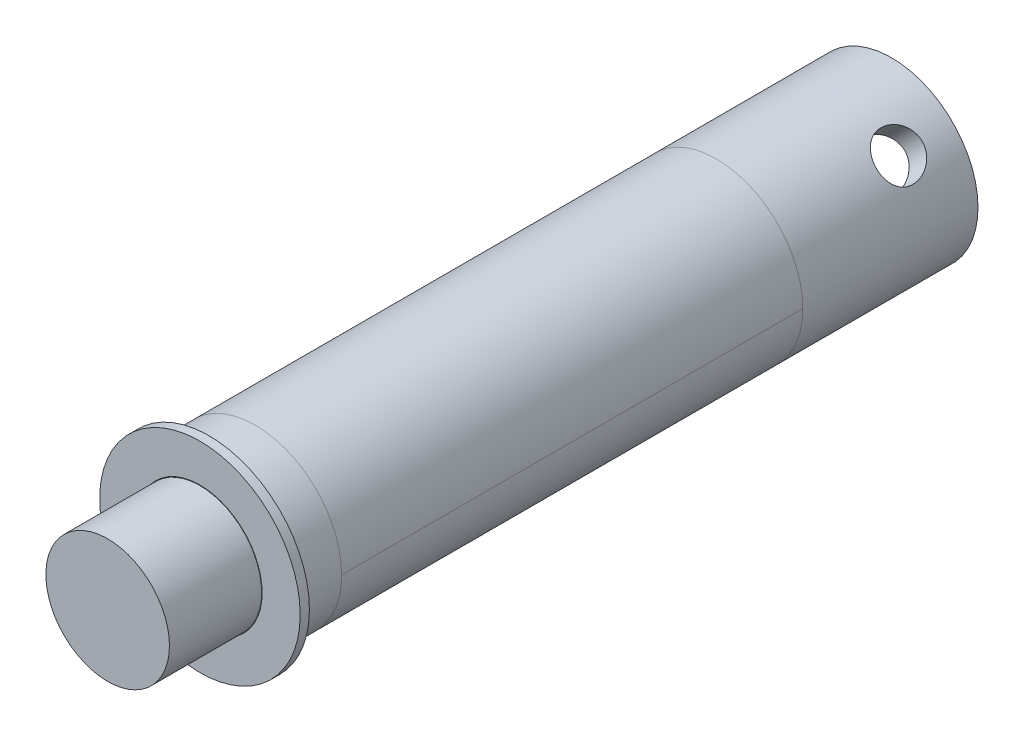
ISO-10303-21;
HEADER;
FILE_DESCRIPTION(('STEP AP214'),'2;1');
FILE_NAME('part.step','',(''),(''),'','','');
FILE_SCHEMA(('AUTOMOTIVE_DESIGN { 1 0 10303 214 1 1 1 1 }'));
ENDSEC;
DATA;
#1=APPLICATION_CONTEXT('core data for automotive mechanical design processes');
#2=APPLICATION_PROTOCOL_DEFINITION('international standard','automotive_design',2000,#1);
#3=PRODUCT_CONTEXT('',#1,'mechanical');
#4=PRODUCT('Part','Part','',(#3));
#5=PRODUCT_RELATED_PRODUCT_CATEGORY('part','',(#4));
#6=PRODUCT_DEFINITION_FORMATION('','',#4);
#7=PRODUCT_DEFINITION_CONTEXT('part definition',#1,'design');
#8=PRODUCT_DEFINITION('design','',#6,#7);
#9=PRODUCT_DEFINITION_SHAPE('','',#8);
#10=(LENGTH_UNIT() NAMED_UNIT(*) SI_UNIT(.MILLI.,.METRE.));
#11=(NAMED_UNIT(*) PLANE_ANGLE_UNIT() SI_UNIT($,.RADIAN.));
#12=(NAMED_UNIT(*) SI_UNIT($,.STERADIAN.) SOLID_ANGLE_UNIT());
#13=UNCERTAINTY_MEASURE_WITH_UNIT(LENGTH_MEASURE(1.E-05),#10,'distance_accuracy_value','');
#14=(GEOMETRIC_REPRESENTATION_CONTEXT(3) GLOBAL_UNCERTAINTY_ASSIGNED_CONTEXT((#13)) GLOBAL_UNIT_ASSIGNED_CONTEXT((#10,
#11,#12)) REPRESENTATION_CONTEXT('',''));
#15=CARTESIAN_POINT('',(0.,0.,0.));
#16=DIRECTION('',(0.,0.,1.));
#17=DIRECTION('',(1.,0.,0.));
#18=AXIS2_PLACEMENT_3D('',#15,#16,#17);
#19=CARTESIAN_POINT('',(0.,0.,215.9));
#20=DIRECTION('',(0.,0.,-1.));
#21=DIRECTION('',(-1.,0.,0.));
#22=AXIS2_PLACEMENT_3D('',#19,#20,#21);
#23=CYLINDRICAL_SURFACE('',#22,17.018);
#24=CARTESIAN_POINT('',(0.,0.,215.9));
#25=DIRECTION('',(0.,0.,1.));
#26=DIRECTION('',(1.,0.,0.));
#27=AXIS2_PLACEMENT_3D('',#24,#25,#26);
#28=CIRCLE('',#27,17.018);
#29=CARTESIAN_POINT('',(17.018,0.,215.9));
#30=VERTEX_POINT('',#29);
#31=EDGE_CURVE('E11',#30,#30,#28,.T.);
#32=ORIENTED_EDGE('',*,*,#31,.F.);
#33=EDGE_LOOP('',(#32));
#34=FACE_BOUND('',#33,.T.);
#35=CARTESIAN_POINT('',(0.,0.,190.5));
#36=DIRECTION('',(0.,0.,1.));
#37=DIRECTION('',(1.,0.,0.));
#38=AXIS2_PLACEMENT_3D('',#35,#36,#37);
#39=CIRCLE('',#38,17.018);
#40=CARTESIAN_POINT('',(17.018,0.,190.5));
#41=VERTEX_POINT('',#40);
#42=EDGE_CURVE('E51',#41,#41,#39,.T.);
#43=ORIENTED_EDGE('',*,*,#42,.T.);
#44=EDGE_LOOP('',(#43));
#45=FACE_BOUND('',#44,.T.);
#46=ADVANCED_FACE('F48',(#34,#45),#23,.T.);
#47=CARTESIAN_POINT('',(0.,0.,215.9));
#48=DIRECTION('',(0.,0.,1.));
#49=DIRECTION('',(1.,0.,0.));
#50=AXIS2_PLACEMENT_3D('',#47,#48,#49);
#51=PLANE('',#50);
#52=ORIENTED_EDGE('',*,*,#31,.T.);
#53=EDGE_LOOP('',(#52));
#54=FACE_BOUND('',#53,.T.);
#55=ADVANCED_FACE('F63',(#54),#51,.T.);
#56=CARTESIAN_POINT('',(0.,0.,190.5));
#57=DIRECTION('',(0.,0.,1.));
#58=DIRECTION('',(1.,0.,0.));
#59=AXIS2_PLACEMENT_3D('',#56,#57,#58);
#60=PLANE('',#59);
#61=ORIENTED_EDGE('',*,*,#42,.F.);
#62=EDGE_LOOP('',(#61));
#63=FACE_BOUND('',#62,.T.);
#64=ADVANCED_FACE('F61',(#63),#60,.F.);
#65=CLOSED_SHELL('',(#46,#55,#64));
#66=MANIFOLD_SOLID_BREP('B2',#65);
#67=CARTESIAN_POINT('',(0.,0.,190.5));
#68=DIRECTION('',(0.,0.,-1.));
#69=DIRECTION('',(-1.,0.,0.));
#70=AXIS2_PLACEMENT_3D('',#67,#68,#69);
#71=CYLINDRICAL_SURFACE('',#70,23.8125);
#72=DIRECTION('',(0.,0.,-1.));
#73=VECTOR('',#72,1.);
#74=CARTESIAN_POINT('',(23.8125,0.,190.5));
#75=LINE('',#74,#73);
#76=CARTESIAN_POINT('',(23.8125,0.,175.26));
#77=VERTEX_POINT('',#76);
#78=CARTESIAN_POINT('',(23.8125,0.,48.26));
#79=VERTEX_POINT('',#78);
#80=EDGE_CURVE('E46',#77,#79,#75,.T.);
#81=ORIENTED_EDGE('',*,*,#80,.F.);
#82=CARTESIAN_POINT('',(0.,0.,175.26));
#83=DIRECTION('',(0.,0.,-1.));
#84=DIRECTION('',(-1.,0.,0.));
#85=AXIS2_PLACEMENT_3D('',#82,#83,#84);
#86=CIRCLE('',#85,23.8125);
#87=CARTESIAN_POINT('',(-23.8125,0.,175.26));
#88=VERTEX_POINT('',#87);
#89=EDGE_CURVE('E196',#77,#88,#86,.T.);
#90=ORIENTED_EDGE('',*,*,#89,.T.);
#91=DIRECTION('',(0.,0.,-1.));
#92=VECTOR('',#91,1.);
#93=CARTESIAN_POINT('',(-23.8125,0.,190.5));
#94=LINE('',#93,#92);
#95=CARTESIAN_POINT('',(-23.8125,0.,48.26));
#96=VERTEX_POINT('',#95);
#97=EDGE_CURVE('E98',#96,#88,#94,.F.);
#98=ORIENTED_EDGE('',*,*,#97,.F.);
#99=CARTESIAN_POINT('',(0.,0.,48.26));
#100=DIRECTION('',(0.,0.,1.));
#101=DIRECTION('',(1.,0.,0.));
#102=AXIS2_PLACEMENT_3D('',#99,#100,#101);
#103=CIRCLE('',#102,23.8125);
#104=EDGE_CURVE('E119',#96,#79,#103,.T.);
#105=ORIENTED_EDGE('',*,*,#104,.T.);
#106=EDGE_LOOP('',(#81,#90,#98,#105));
#107=FACE_BOUND('',#106,.T.);
#108=ADVANCED_FACE('F88',(#107),#71,.T.);
#109=CARTESIAN_POINT('',(-20.8590593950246,-11.4862873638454,14.9217756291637));
#110=CARTESIAN_POINT('',(-20.8590605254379,-11.4862799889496,15.0967353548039));
#111=CARTESIAN_POINT('',(-20.8554421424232,-11.4928622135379,15.271632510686));
#112=CARTESIAN_POINT('',(-20.8409713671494,-11.5190852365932,15.6201923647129));
#113=CARTESIAN_POINT('',(-20.8301182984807,-11.5387272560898,15.7938549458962));
#114=CARTESIAN_POINT('',(-20.8011745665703,-11.5908226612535,16.1386700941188));
#115=CARTESIAN_POINT('',(-20.7830820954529,-11.6232792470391,16.309822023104));
#116=CARTESIAN_POINT('',(-20.7396548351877,-11.7005914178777,16.648432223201));
#117=CARTESIAN_POINT('',(-20.7143173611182,-11.7454515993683,16.8158891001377));
#118=CARTESIAN_POINT('',(-20.6564589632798,-11.8469092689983,17.1455899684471));
#119=CARTESIAN_POINT('',(-20.6239510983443,-11.9034854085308,17.3078428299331));
#120=CARTESIAN_POINT('',(-20.5517177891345,-12.0277685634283,17.6264372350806));
#121=CARTESIAN_POINT('',(-20.5119896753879,-12.0954796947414,17.7827765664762));
#122=CARTESIAN_POINT('',(-20.4253470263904,-12.2412228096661,18.0884284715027));
#123=CARTESIAN_POINT('',(-20.3784348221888,-12.3192514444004,18.2377433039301));
#124=CARTESIAN_POINT('',(-20.2774127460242,-12.4848345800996,18.5285231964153));
#125=CARTESIAN_POINT('',(-20.2233001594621,-12.5723926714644,18.6699852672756));
#126=CARTESIAN_POINT('',(-20.1066369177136,-12.7581581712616,18.9471813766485));
#127=CARTESIAN_POINT('',(-20.0439253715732,-12.8565591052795,19.0827180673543));
#128=CARTESIAN_POINT('',(-19.9110588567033,-13.0613856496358,19.3437964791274));
#129=CARTESIAN_POINT('',(-19.840901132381,-13.1678142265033,19.4693344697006));
#130=CARTESIAN_POINT('',(-19.6932729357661,-13.3875939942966,19.7095134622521));
#131=CARTESIAN_POINT('',(-19.615804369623,-13.5009433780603,19.8241572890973));
#132=CARTESIAN_POINT('',(-19.4536524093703,-13.7335599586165,20.0418577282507));
#133=CARTESIAN_POINT('',(-19.3689663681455,-13.852829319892,20.1449100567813));
#134=CARTESIAN_POINT('',(-19.1912091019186,-14.0980829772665,20.3402010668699));
#135=CARTESIAN_POINT('',(-19.0980260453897,-14.2241438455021,20.4322419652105));
#136=CARTESIAN_POINT('',(-18.9047560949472,-14.4800226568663,20.6028777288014));
#137=CARTESIAN_POINT('',(-18.804669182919,-14.6098406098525,20.6814725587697));
#138=CARTESIAN_POINT('',(-18.5980097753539,-14.8720221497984,20.8245797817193));
#139=CARTESIAN_POINT('',(-18.4914381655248,-15.0043853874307,20.8890940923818));
#140=CARTESIAN_POINT('',(-18.2723136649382,-15.2704750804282,21.0035117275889));
#141=CARTESIAN_POINT('',(-18.1597607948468,-15.4042015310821,21.0534151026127));
#142=CARTESIAN_POINT('',(-17.9319552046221,-15.6687558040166,21.1372003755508));
#143=CARTESIAN_POINT('',(-17.8168234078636,-15.7995798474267,21.1714231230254));
#144=CARTESIAN_POINT('',(-17.582169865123,-16.0602993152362,21.2252024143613));
#145=CARTESIAN_POINT('',(-17.4626482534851,-16.1901947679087,21.2447594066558));
#146=CARTESIAN_POINT('',(-17.2200424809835,-16.4479974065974,21.2690321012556));
#147=CARTESIAN_POINT('',(-17.0969588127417,-16.5759048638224,21.2737498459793));
#148=CARTESIAN_POINT('',(-16.8481202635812,-16.8287689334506,21.2683072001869));
#149=CARTESIAN_POINT('',(-16.7223654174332,-16.9537255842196,21.2581470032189));
#150=CARTESIAN_POINT('',(-16.4723913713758,-17.1966589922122,21.2234873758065));
#151=CARTESIAN_POINT('',(-16.3482144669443,-17.3147324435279,21.1993592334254));
#152=CARTESIAN_POINT('',(-16.0991826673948,-17.5465217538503,21.1372548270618));
#153=CARTESIAN_POINT('',(-15.9743275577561,-17.6602361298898,21.0992738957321));
#154=CARTESIAN_POINT('',(-15.7250133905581,-17.8825888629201,21.0097820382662));
#155=CARTESIAN_POINT('',(-15.6005542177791,-17.9912288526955,20.9582755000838));
#156=CARTESIAN_POINT('',(-15.3530030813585,-18.2029407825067,20.8421428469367));
#157=CARTESIAN_POINT('',(-15.229911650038,-18.306010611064,20.777511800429));
#158=CARTESIAN_POINT('',(-14.8619123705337,-18.6080537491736,20.5632453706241));
#159=CARTESIAN_POINT('',(-14.6205273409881,-18.7978702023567,20.3940431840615));
#160=CARTESIAN_POINT('',(-14.1560495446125,-19.1501106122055,20.0088417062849));
#161=CARTESIAN_POINT('',(-13.9329603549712,-19.3125292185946,19.7928332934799));
#162=CARTESIAN_POINT('',(-13.5065353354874,-19.6132304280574,19.3122451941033));
#163=CARTESIAN_POINT('',(-13.304016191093,-19.7506189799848,19.0463779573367));
#164=CARTESIAN_POINT('',(-12.9352197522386,-19.9941054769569,18.4776915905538));
#165=CARTESIAN_POINT('',(-12.7689446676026,-20.1002015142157,18.174870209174));
#166=CARTESIAN_POINT('',(-12.4793100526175,-20.2813073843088,17.5383095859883));
#167=CARTESIAN_POINT('',(-12.3562214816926,-20.3561214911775,17.2043912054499));
#168=CARTESIAN_POINT('',(-12.1607735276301,-20.4734949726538,16.5164324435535));
#169=CARTESIAN_POINT('',(-12.0884015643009,-20.5160623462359,16.162397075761));
#170=CARTESIAN_POINT('',(-12.0215633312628,-20.5552334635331,15.6301652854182));
#171=CARTESIAN_POINT('',(-12.0061725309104,-20.5642172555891,15.4551974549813));
#172=CARTESIAN_POINT('',(-11.9884307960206,-20.5745678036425,15.1043932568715));
#173=CARTESIAN_POINT('',(-11.9860749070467,-20.5759374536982,14.9285572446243));
#174=CARTESIAN_POINT('',(-11.9944467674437,-20.5710576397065,14.5773001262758));
#175=CARTESIAN_POINT('',(-12.0051757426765,-20.5648074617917,14.4018790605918));
#176=CARTESIAN_POINT('',(-12.0395640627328,-20.5446940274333,14.0527515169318));
#177=CARTESIAN_POINT('',(-12.0632230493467,-20.5308309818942,13.8790449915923));
#178=CARTESIAN_POINT('',(-12.122572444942,-20.4958423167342,13.5379294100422));
#179=CARTESIAN_POINT('',(-12.1580223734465,-20.4748617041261,13.3704634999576));
#180=CARTESIAN_POINT('',(-12.2405990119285,-20.4256016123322,13.0395339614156));
#181=CARTESIAN_POINT('',(-12.287725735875,-20.3973221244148,12.8760703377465));
#182=CARTESIAN_POINT('',(-12.3930943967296,-20.3334738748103,12.5541830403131));
#183=CARTESIAN_POINT('',(-12.4513392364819,-20.29790320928,12.3957606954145));
#184=CARTESIAN_POINT('',(-12.5782360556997,-20.2195126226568,12.0850620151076));
#185=CARTESIAN_POINT('',(-12.6468846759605,-20.1766950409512,11.9327837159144));
#186=CARTESIAN_POINT('',(-12.7954858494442,-20.0827934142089,11.6319349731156));
#187=CARTESIAN_POINT('',(-12.8756565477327,-20.0315461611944,11.4835232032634));
#188=CARTESIAN_POINT('',(-13.0451885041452,-19.9215565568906,11.1950337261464));
#189=CARTESIAN_POINT('',(-13.134546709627,-19.8628166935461,11.0549532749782));
#190=CARTESIAN_POINT('',(-13.3215947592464,-19.7378550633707,10.7838729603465));
#191=CARTESIAN_POINT('',(-13.4192888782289,-19.6716294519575,10.6528778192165));
#192=CARTESIAN_POINT('',(-13.6219615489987,-19.5318321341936,10.4009100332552));
#193=CARTESIAN_POINT('',(-13.726937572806,-19.4582629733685,10.2799339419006));
#194=CARTESIAN_POINT('',(-13.9463776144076,-19.3016166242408,10.0453273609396));
#195=CARTESIAN_POINT('',(-14.0610296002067,-19.2183238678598,9.93201634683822));
#196=CARTESIAN_POINT('',(-14.2958574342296,-19.0442895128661,9.71760040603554));
#197=CARTESIAN_POINT('',(-14.4160312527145,-18.95355064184,9.61649104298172));
#198=CARTESIAN_POINT('',(-14.6608405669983,-18.7648288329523,9.42712872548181));
#199=CARTESIAN_POINT('',(-14.785477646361,-18.6668433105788,9.33888039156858));
#200=CARTESIAN_POINT('',(-15.0379543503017,-18.4640539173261,9.17599122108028));
#201=CARTESIAN_POINT('',(-15.1657926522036,-18.3592528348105,9.10134486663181));
#202=CARTESIAN_POINT('',(-15.4226114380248,-18.1440369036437,8.96670488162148));
#203=CARTESIAN_POINT('',(-15.551577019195,-18.0336680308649,8.90660938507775));
#204=CARTESIAN_POINT('',(-15.8103485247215,-17.8072338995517,8.80090158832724));
#205=CARTESIAN_POINT('',(-15.9401541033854,-17.6911708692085,8.75528367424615));
#206=CARTESIAN_POINT('',(-16.1995183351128,-17.4539864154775,8.67889696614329));
#207=CARTESIAN_POINT('',(-16.3290769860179,-17.3328649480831,8.64812830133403));
#208=CARTESIAN_POINT('',(-16.5868403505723,-17.0863594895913,8.60171897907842));
#209=CARTESIAN_POINT('',(-16.7150450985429,-16.9609756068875,8.58607793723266));
#210=CARTESIAN_POINT('',(-16.9651274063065,-16.7107727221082,8.57031342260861));
#211=CARTESIAN_POINT('',(-17.0870780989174,-16.5860558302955,8.56972570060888));
#212=CARTESIAN_POINT('',(-17.3278793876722,-16.3343227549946,8.58289842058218));
#213=CARTESIAN_POINT('',(-17.4467289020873,-16.2073057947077,8.59666380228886));
#214=CARTESIAN_POINT('',(-17.6804286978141,-15.9520384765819,8.63842263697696));
#215=CARTESIAN_POINT('',(-17.795280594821,-15.8237886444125,8.66641026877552));
#216=CARTESIAN_POINT('',(-18.0203685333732,-15.5669727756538,8.7363857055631));
#217=CARTESIAN_POINT('',(-18.130602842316,-15.4384066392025,8.7783787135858));
#218=CARTESIAN_POINT('',(-18.3450171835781,-15.1829873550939,8.87566023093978));
#219=CARTESIAN_POINT('',(-18.4492354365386,-15.0561285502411,8.93084976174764));
#220=CARTESIAN_POINT('',(-18.6520181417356,-14.8041729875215,9.05427253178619));
#221=CARTESIAN_POINT('',(-18.7505806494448,-14.679076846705,9.12251022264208));
#222=CARTESIAN_POINT('',(-18.9416079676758,-14.4317380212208,9.27150400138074));
#223=CARTESIAN_POINT('',(-19.0340732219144,-14.309495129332,9.35225917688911));
#224=CARTESIAN_POINT('',(-19.2126071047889,-14.0688781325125,9.5257221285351));
#225=CARTESIAN_POINT('',(-19.2986755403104,-13.9505041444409,9.61843026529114));
#226=CARTESIAN_POINT('',(-19.4664048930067,-13.7155251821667,9.81781684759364));
#227=CARTESIAN_POINT('',(-19.547885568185,-13.599052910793,9.92480341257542));
#228=CARTESIAN_POINT('',(-19.7036527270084,-13.372364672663,10.149959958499));
#229=CARTESIAN_POINT('',(-19.7779414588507,-13.2621467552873,10.2681264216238));
#230=CARTESIAN_POINT('',(-19.9192769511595,-13.0489055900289,10.5149746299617));
#231=CARTESIAN_POINT('',(-19.9863193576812,-12.9458866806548,10.6436626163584));
#232=CARTESIAN_POINT('',(-20.1130112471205,-12.7481653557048,10.9106212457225));
#233=CARTESIAN_POINT('',(-20.1726633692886,-12.6534599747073,11.0488884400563));
#234=CARTESIAN_POINT('',(-20.2858128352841,-12.4712755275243,11.337374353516));
#235=CARTESIAN_POINT('',(-20.3391422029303,-12.3840060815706,11.4877915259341));
#236=CARTESIAN_POINT('',(-20.4380081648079,-12.2201527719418,11.7967090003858));
#237=CARTESIAN_POINT('',(-20.4835476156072,-12.1435649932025,11.9552063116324));
#238=CARTESIAN_POINT('',(-20.5668294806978,-12.0019763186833,12.2792075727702));
#239=CARTESIAN_POINT('',(-20.6045747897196,-11.936971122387,12.4447088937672));
#240=CARTESIAN_POINT('',(-20.6722721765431,-11.8193444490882,12.781544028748));
#241=CARTESIAN_POINT('',(-20.7022253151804,-11.7667212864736,12.9528770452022));
#242=CARTESIAN_POINT('',(-20.7718571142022,-11.6435864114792,13.4169319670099));
#243=CARTESIAN_POINT('',(-20.8045656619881,-11.584781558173,13.7139297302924));
#244=CARTESIAN_POINT('',(-20.8481645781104,-11.5061406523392,14.31460680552));
#245=CARTESIAN_POINT('',(-20.8590574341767,-11.4863001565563,14.6182853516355));
#246=CARTESIAN_POINT('',(-20.8590593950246,-11.4862873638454,14.9217756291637));
#247=B_SPLINE_CURVE_WITH_KNOTS('',3,(#109,#110,#111,#112,#113,#114,#115,#116,#117,#118,#119,
#120,#121,#122,#123,#124,#125,#126,#127,#128,#129,#130,#131,#132,#133,#134,#135,#136,#137,#138,
#139,#140,#141,#142,#143,#144,#145,#146,#147,#148,#149,#150,#151,#152,#153,#154,#155,#156,#157,
#158,#159,#160,#161,#162,#163,#164,#165,#166,#167,#168,#169,#170,#171,#172,#173,#174,#175,#176,
#177,#178,#179,#180,#181,#182,#183,#184,#185,#186,#187,#188,#189,#190,#191,#192,#193,#194,#195,
#196,#197,#198,#199,#200,#201,#202,#203,#204,#205,#206,#207,#208,#209,#210,#211,#212,#213,#214,
#215,#216,#217,#218,#219,#220,#221,#222,#223,#224,#225,#226,#227,#228,#229,#230,#231,#232,#233,
#234,#235,#236,#237,#238,#239,#240,#241,#242,#243,#244,#245,#246),.UNSPECIFIED.,.T.,.F.,(4,2,2,
2,2,2,2,2,2,2,2,2,2,2,2,2,2,2,2,2,2,2,2,2,2,2,2,2,2,2,2,2,2,2,2,2,2,2,2,2,2,2,2,2,2,2,2,2,2,2,2,
2,2,2,2,2,2,2,2,2,2,2,2,2,2,2,2,2,4),(0.,0.524610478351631,1.04927001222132,1.57406064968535,
2.09904602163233,2.62308306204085,3.14731424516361,3.67137568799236,4.19563526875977,
4.7315538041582,5.26767136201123,5.80364952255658,6.33982511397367,6.88451804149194,
7.42921239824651,7.97383252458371,8.51845076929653,9.05059219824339,9.5827173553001,
10.1147692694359,10.6468142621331,11.1653268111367,11.6840142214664,12.2025335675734,
12.7212481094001,13.7678904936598,14.8147370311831,15.8937216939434,16.9727721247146,
18.0584764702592,19.1439114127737,19.6709998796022,20.1978879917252,20.7248254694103,
21.2517483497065,21.7685235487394,22.2852993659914,22.8022102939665,23.3189546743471,
23.8472353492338,24.3753410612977,24.903719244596,25.4319149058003,25.9756010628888,
26.5190889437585,27.0627716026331,27.6062332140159,28.1457724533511,28.6851022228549,
29.2244366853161,29.7637574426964,30.2864246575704,30.8092718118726,31.3319051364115,
31.8547328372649,32.3737557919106,32.8929561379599,33.4121186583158,33.9312968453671,
34.4644064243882,34.9973488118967,35.5306096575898,36.0636795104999,36.6087008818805,
37.1535219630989,37.6981403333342,38.2426845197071,39.1527930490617,40.0627977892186),.UNSPECIFIED.);
#248=CARTESIAN_POINT('',(-20.8590593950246,-11.4862873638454,14.9217756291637));
#249=VERTEX_POINT('',#248);
#250=EDGE_CURVE('E137',#249,#249,#247,.T.);
#251=ORIENTED_EDGE('',*,*,#250,.T.);
#252=EDGE_LOOP('',(#251));
#253=FACE_BOUND('',#252,.T.);
#254=CARTESIAN_POINT('',(11.9882480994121,20.5746704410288,14.9217756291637));
#255=CARTESIAN_POINT('',(11.9882407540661,20.5746717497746,14.7468159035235));
#256=CARTESIAN_POINT('',(11.9947333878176,20.5708949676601,14.5719187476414));
#257=CARTESIAN_POINT('',(12.0205981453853,20.5557931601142,14.2233588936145));
#258=CARTESIAN_POINT('',(12.039971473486,20.5444674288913,14.0496963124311));
#259=CARTESIAN_POINT('',(12.0913503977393,20.5142701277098,13.7048811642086));
#260=CARTESIAN_POINT('',(12.1233591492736,20.4953966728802,13.5337292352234));
#261=CARTESIAN_POINT('',(12.1995965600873,20.450109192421,13.1951190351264));
#262=CARTESIAN_POINT('',(12.2438297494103,20.4236923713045,13.0276621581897));
#263=CARTESIAN_POINT('',(12.3438559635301,20.3633930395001,12.6979612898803));
#264=CARTESIAN_POINT('',(12.399627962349,20.3295241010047,12.5357084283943));
#265=CARTESIAN_POINT('',(12.5221247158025,20.2543011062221,12.2171140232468));
#266=CARTESIAN_POINT('',(12.5888535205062,20.2129442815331,12.0607746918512));
#267=CARTESIAN_POINT('',(12.7324548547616,20.122796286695,11.7551227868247));
#268=CARTESIAN_POINT('',(12.8093240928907,20.074007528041,11.6058079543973));
#269=CARTESIAN_POINT('',(12.9724112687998,19.969003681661,11.315028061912));
#270=CARTESIAN_POINT('',(13.058632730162,19.9127857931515,11.1735659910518));
#271=CARTESIAN_POINT('',(13.2415174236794,19.7916564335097,10.8963698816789));
#272=CARTESIAN_POINT('',(13.3383702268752,19.7265794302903,10.7608331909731));
#273=CARTESIAN_POINT('',(13.539917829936,19.5887897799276,10.4997547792));
#274=CARTESIAN_POINT('',(13.6446155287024,19.5160743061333,10.3742167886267));
#275=CARTESIAN_POINT('',(13.860754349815,19.3631650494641,10.1340377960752));
#276=CARTESIAN_POINT('',(13.9721937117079,19.2829732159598,10.0193939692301));
#277=CARTESIAN_POINT('',(14.2008137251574,19.1152334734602,9.80169353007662));
#278=CARTESIAN_POINT('',(14.3179964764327,19.02768286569,9.69864120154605));
#279=CARTESIAN_POINT('',(14.558871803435,18.8440362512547,9.50335019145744));
#280=CARTESIAN_POINT('',(14.6826382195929,18.7478265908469,9.41130929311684));
#281=CARTESIAN_POINT('',(14.9337597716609,18.5484144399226,9.24067352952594));
#282=CARTESIAN_POINT('',(15.0611149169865,18.4452119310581,9.16207869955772));
#283=CARTESIAN_POINT('',(15.3182129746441,18.2322615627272,9.01897147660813));
#284=CARTESIAN_POINT('',(15.4479555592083,18.1225145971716,8.9544571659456));
#285=CARTESIAN_POINT('',(15.708658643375,17.8970081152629,8.84003953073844));
#286=CARTESIAN_POINT('',(15.8396191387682,17.7812486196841,8.79013615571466));
#287=CARTESIAN_POINT('',(16.0985769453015,17.5471007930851,8.70635088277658));
#288=CARTESIAN_POINT('',(16.2265734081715,17.4288334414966,8.67212813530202));
#289=CARTESIAN_POINT('',(16.4815316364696,17.1879325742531,8.61834884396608));
#290=CARTESIAN_POINT('',(16.608493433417,17.0652991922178,8.59879185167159));
#291=CARTESIAN_POINT('',(16.8603430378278,16.816519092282,8.57451915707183));
#292=CARTESIAN_POINT('',(16.9852311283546,16.6903728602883,8.56980141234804));
#293=CARTESIAN_POINT('',(17.231992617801,16.4354814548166,8.57524405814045));
#294=CARTESIAN_POINT('',(17.3538660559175,16.3067363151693,8.58540425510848));
#295=CARTESIAN_POINT('',(17.5906722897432,16.050950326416,8.62006388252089));
#296=CARTESIAN_POINT('',(17.7057027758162,15.9239494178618,8.64419202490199));
#297=CARTESIAN_POINT('',(17.9313910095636,15.6693753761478,8.70629643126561));
#298=CARTESIAN_POINT('',(18.042047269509,15.5418020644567,8.74427736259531));
#299=CARTESIAN_POINT('',(18.2582948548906,15.2871743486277,8.83376922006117));
#300=CARTESIAN_POINT('',(18.3638878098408,15.160119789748,8.88527575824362));
#301=CARTESIAN_POINT('',(18.5695404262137,14.9075123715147,9.00140841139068));
#302=CARTESIAN_POINT('',(18.6695979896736,14.7819600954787,9.06603945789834));
#303=CARTESIAN_POINT('',(18.9626373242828,14.4067515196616,9.28030588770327));
#304=CARTESIAN_POINT('',(19.1465502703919,14.1608388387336,9.44950807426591));
#305=CARTESIAN_POINT('',(19.4874348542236,13.6879639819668,9.8347095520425));
#306=CARTESIAN_POINT('',(19.6444012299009,13.4610055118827,10.0507179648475));
#307=CARTESIAN_POINT('',(19.9346836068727,13.0274208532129,10.5313060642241));
#308=CARTESIAN_POINT('',(20.0671256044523,12.8216327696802,10.7971733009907));
#309=CARTESIAN_POINT('',(20.3016061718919,12.4470458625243,11.3658596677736));
#310=CARTESIAN_POINT('',(20.4036428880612,12.2782492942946,11.6686810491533));
#311=CARTESIAN_POINT('',(20.5776789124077,11.9843122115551,12.3052416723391));
#312=CARTESIAN_POINT('',(20.6494891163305,11.859447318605,12.6391600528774));
#313=CARTESIAN_POINT('',(20.7620932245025,11.661213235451,13.3271188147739));
#314=CARTESIAN_POINT('',(20.8028948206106,11.5878312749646,13.6811541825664));
#315=CARTESIAN_POINT('',(20.8404352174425,11.520063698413,14.2133859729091));
#316=CARTESIAN_POINT('',(20.8490435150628,11.5044597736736,14.3883538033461));
#317=CARTESIAN_POINT('',(20.8589612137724,11.4864724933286,14.7391580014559));
#318=CARTESIAN_POINT('',(20.8602733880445,11.4840841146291,14.9149940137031));
#319=CARTESIAN_POINT('',(20.8555978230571,11.4925717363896,15.2662511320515));
#320=CARTESIAN_POINT('',(20.8496093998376,11.5034489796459,15.4416721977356));
#321=CARTESIAN_POINT('',(20.8303349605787,11.5383144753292,15.7907997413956));
#322=CARTESIAN_POINT('',(20.8170491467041,11.5623023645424,15.9645062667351));
#323=CARTESIAN_POINT('',(20.7835085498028,11.6224819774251,16.3056218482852));
#324=CARTESIAN_POINT('',(20.7633929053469,11.658429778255,16.4730877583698));
#325=CARTESIAN_POINT('',(20.7161477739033,11.7421755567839,16.8040172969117));
#326=CARTESIAN_POINT('',(20.689018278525,11.7899735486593,16.9674809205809));
#327=CARTESIAN_POINT('',(20.6277414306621,11.8968580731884,17.2893682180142));
#328=CARTESIAN_POINT('',(20.5935922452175,11.9559475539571,17.4477905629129));
#329=CARTESIAN_POINT('',(20.518298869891,12.0847062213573,17.7584892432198));
#330=CARTESIAN_POINT('',(20.4771569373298,12.1543719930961,17.910767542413));
#331=CARTESIAN_POINT('',(20.3868828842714,12.3052044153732,18.2116162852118));
#332=CARTESIAN_POINT('',(20.3375928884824,12.3865931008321,18.360028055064));
#333=CARTESIAN_POINT('',(20.2317426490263,12.5587399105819,18.648517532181));
#334=CARTESIAN_POINT('',(20.1751848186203,12.6494949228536,18.7885979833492));
#335=CARTESIAN_POINT('',(20.0547912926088,12.8395153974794,19.0596782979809));
#336=CARTESIAN_POINT('',(19.9909518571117,12.9387852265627,19.1906734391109));
#337=CARTESIAN_POINT('',(19.8561055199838,13.1447851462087,19.4426412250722));
#338=CARTESIAN_POINT('',(19.7851011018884,13.2515126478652,19.5636173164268));
#339=CARTESIAN_POINT('',(19.6338168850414,13.4746832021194,19.7982238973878));
#340=CARTESIAN_POINT('',(19.5533261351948,13.5913193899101,19.9115349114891));
#341=CARTESIAN_POINT('',(19.3850318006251,13.830294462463,20.1259508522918));
#342=CARTESIAN_POINT('',(19.2972308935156,13.9526312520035,20.2270602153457));
#343=CARTESIAN_POINT('',(19.1144952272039,14.2019406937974,20.4164225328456));
#344=CARTESIAN_POINT('',(19.019557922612,14.3289149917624,20.5046708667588));
#345=CARTESIAN_POINT('',(18.8229445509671,14.5862303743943,20.6675600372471));
#346=CARTESIAN_POINT('',(18.7212712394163,14.7165700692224,20.7422063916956));
#347=CARTESIAN_POINT('',(18.5123401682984,14.9785273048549,20.8768463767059));
#348=CARTESIAN_POINT('',(18.4051280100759,15.1101288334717,20.9369418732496));
#349=CARTESIAN_POINT('',(18.1850293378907,15.3743099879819,21.0426496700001));
#350=CARTESIAN_POINT('',(18.0721450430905,15.5068892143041,21.0882675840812));
#351=CARTESIAN_POINT('',(17.8413135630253,15.7719233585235,21.1646542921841));
#352=CARTESIAN_POINT('',(17.7233663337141,15.904378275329,21.1954229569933));
#353=CARTESIAN_POINT('',(17.4831778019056,16.1680378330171,21.241832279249));
#354=CARTESIAN_POINT('',(17.3609366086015,16.2992425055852,21.2574733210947));
#355=CARTESIAN_POINT('',(17.1168656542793,16.5553128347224,21.2732378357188));
#356=CARTESIAN_POINT('',(16.9951397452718,16.6802491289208,21.2738255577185));
#357=CARTESIAN_POINT('',(16.7493142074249,16.9270782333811,21.2606528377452));
#358=CARTESIAN_POINT('',(16.6252137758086,17.0489699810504,21.2468874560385));
#359=CARTESIAN_POINT('',(16.3756829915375,17.2887852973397,21.2051286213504));
#360=CARTESIAN_POINT('',(16.2502532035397,17.4067104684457,21.1771409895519));
#361=CARTESIAN_POINT('',(15.9989656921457,17.6379539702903,21.1071655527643));
#362=CARTESIAN_POINT('',(15.8731078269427,17.7512705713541,21.0651725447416));
#363=CARTESIAN_POINT('',(15.6229579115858,17.9718097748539,20.9678910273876));
#364=CARTESIAN_POINT('',(15.4986611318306,18.0790707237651,20.9127014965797));
#365=CARTESIAN_POINT('',(15.2516921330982,18.2878977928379,20.7892787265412));
#366=CARTESIAN_POINT('',(15.1290204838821,18.3894619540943,20.7210410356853));
#367=CARTESIAN_POINT('',(14.8863820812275,18.58642524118,20.5720472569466));
#368=CARTESIAN_POINT('',(14.7664151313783,18.6818248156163,20.4912920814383));
#369=CARTESIAN_POINT('',(14.5301939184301,18.8661354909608,20.3178291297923));
#370=CARTESIAN_POINT('',(14.4139397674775,18.9550463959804,20.2251209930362));
#371=CARTESIAN_POINT('',(14.1830931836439,19.1284191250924,20.0257344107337));
#372=CARTESIAN_POINT('',(14.0686290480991,19.2126975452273,19.9187478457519));
#373=CARTESIAN_POINT('',(13.8457809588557,19.3739107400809,19.6935912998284));
#374=CARTESIAN_POINT('',(13.7373951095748,19.4508478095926,19.5754248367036));
#375=CARTESIAN_POINT('',(13.527640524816,19.5973078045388,19.3285766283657));
#376=CARTESIAN_POINT('',(13.4262760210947,19.6668262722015,19.199888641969));
#377=CARTESIAN_POINT('',(13.2316819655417,19.7982709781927,18.9329300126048));
#378=CARTESIAN_POINT('',(13.1384495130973,19.8601999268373,18.794662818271));
#379=CARTESIAN_POINT('',(12.9590596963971,19.9777297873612,18.5061769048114));
#380=CARTESIAN_POINT('',(12.8731078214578,20.0331576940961,18.3557597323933));
#381=CARTESIAN_POINT('',(12.7116977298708,20.1359641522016,18.0468422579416));
#382=CARTESIAN_POINT('',(12.6362356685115,20.1833456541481,17.888344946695));
#383=CARTESIAN_POINT('',(12.4967061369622,20.2700332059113,17.5643436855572));
#384=CARTESIAN_POINT('',(12.4326344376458,20.3093422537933,17.3988423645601));
#385=CARTESIAN_POINT('',(12.3166823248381,20.3798693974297,17.0620072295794));
#386=CARTESIAN_POINT('',(12.2648002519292,20.411088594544,16.8906742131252));
#387=CARTESIAN_POINT('',(12.1433884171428,20.4836830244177,16.4266192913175));
#388=CARTESIAN_POINT('',(12.0853932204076,20.5178065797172,16.1296215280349));
#389=CARTESIAN_POINT('',(12.0078316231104,20.5632978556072,15.5289444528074));
#390=CARTESIAN_POINT('',(11.9882608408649,20.5746681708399,15.2252659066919));
#391=CARTESIAN_POINT('',(11.9882480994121,20.5746704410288,14.9217756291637));
#392=B_SPLINE_CURVE_WITH_KNOTS('',3,(#254,#255,#256,#257,#258,#259,#260,#261,#262,#263,#264,
#265,#266,#267,#268,#269,#270,#271,#272,#273,#274,#275,#276,#277,#278,#279,#280,#281,#282,#283,
#284,#285,#286,#287,#288,#289,#290,#291,#292,#293,#294,#295,#296,#297,#298,#299,#300,#301,#302,
#303,#304,#305,#306,#307,#308,#309,#310,#311,#312,#313,#314,#315,#316,#317,#318,#319,#320,#321,
#322,#323,#324,#325,#326,#327,#328,#329,#330,#331,#332,#333,#334,#335,#336,#337,#338,#339,#340,
#341,#342,#343,#344,#345,#346,#347,#348,#349,#350,#351,#352,#353,#354,#355,#356,#357,#358,#359,
#360,#361,#362,#363,#364,#365,#366,#367,#368,#369,#370,#371,#372,#373,#374,#375,#376,#377,#378,
#379,#380,#381,#382,#383,#384,#385,#386,#387,#388,#389,#390,#391),.UNSPECIFIED.,.T.,.F.,(4,2,2,
2,2,2,2,2,2,2,2,2,2,2,2,2,2,2,2,2,2,2,2,2,2,2,2,2,2,2,2,2,2,2,2,2,2,2,2,2,2,2,2,2,2,2,2,2,2,2,2,
2,2,2,2,2,2,2,2,2,2,2,2,2,2,2,2,2,4),(0.,0.524610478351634,1.04927001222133,1.57406064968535,
2.09904602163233,2.62308306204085,3.14731424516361,3.67137568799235,4.19563526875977,
4.7315538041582,5.26767136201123,5.80364952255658,6.33982511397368,6.88451804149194,
7.42921239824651,7.97383252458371,8.51845076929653,9.0505921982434,9.5827173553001,
10.1147692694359,10.6468142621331,11.1653268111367,11.6840142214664,12.2025335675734,
12.7212481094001,13.7678904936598,14.8147370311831,15.8937216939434,16.9727721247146,
18.0584764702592,19.1439114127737,19.6709998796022,20.1978879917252,20.7248254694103,
21.2517483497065,21.7685235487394,22.2852993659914,22.8022102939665,23.3189546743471,
23.8472353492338,24.3753410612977,24.903719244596,25.4319149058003,25.9756010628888,
26.5190889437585,27.0627716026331,27.6062332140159,28.1457724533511,28.6851022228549,
29.2244366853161,29.7637574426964,30.2864246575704,30.8092718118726,31.3319051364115,
31.8547328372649,32.3737557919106,32.8929561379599,33.4121186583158,33.9312968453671,
34.4644064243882,34.9973488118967,35.5306096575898,36.0636795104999,36.6087008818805,
37.1535219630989,37.6981403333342,38.2426845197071,39.1527930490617,40.0627977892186),.UNSPECIFIED.);
#393=CARTESIAN_POINT('',(11.9882480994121,20.5746704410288,14.9217756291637));
#394=VERTEX_POINT('',#393);
#395=EDGE_CURVE('E125',#394,#394,#392,.T.);
#396=ORIENTED_EDGE('',*,*,#395,.T.);
#397=EDGE_LOOP('',(#396));
#398=FACE_BOUND('',#397,.T.);
#399=CARTESIAN_POINT('',(0.,0.,0.));
#400=DIRECTION('',(0.,0.,1.));
#401=DIRECTION('',(1.,0.,0.));
#402=AXIS2_PLACEMENT_3D('',#399,#400,#401);
#403=CIRCLE('',#402,23.8125);
#404=CARTESIAN_POINT('',(23.8125,0.,0.));
#405=VERTEX_POINT('',#404);
#406=EDGE_CURVE('E202',#405,#405,#403,.T.);
#407=ORIENTED_EDGE('',*,*,#406,.T.);
#408=EDGE_LOOP('',(#407));
#409=FACE_BOUND('',#408,.T.);
#410=EDGE_CURVE('E115',#79,#96,#103,.T.);
#411=ORIENTED_EDGE('',*,*,#410,.F.);
#412=ORIENTED_EDGE('',*,*,#104,.F.);
#413=EDGE_LOOP('',(#411,#412));
#414=FACE_BOUND('',#413,.T.);
#415=ADVANCED_FACE('F123',(#253,#398,#409,#414),#71,.T.);
#416=CARTESIAN_POINT('',(0.,0.,187.96));
#417=DIRECTION('',(0.,0.,1.));
#418=DIRECTION('',(1.,0.,0.));
#419=AXIS2_PLACEMENT_3D('',#416,#417,#418);
#420=CIRCLE('',#419,23.8125);
#421=CARTESIAN_POINT('',(23.8125,0.,187.96));
#422=VERTEX_POINT('',#421);
#423=EDGE_CURVE('E195',#422,#422,#420,.T.);
#424=ORIENTED_EDGE('',*,*,#423,.F.);
#425=EDGE_LOOP('',(#424));
#426=FACE_BOUND('',#425,.T.);
#427=EDGE_CURVE('E117',#88,#77,#86,.T.);
#428=ORIENTED_EDGE('',*,*,#427,.F.);
#429=ORIENTED_EDGE('',*,*,#89,.F.);
#430=EDGE_LOOP('',(#428,#429));
#431=FACE_BOUND('',#430,.T.);
#432=ADVANCED_FACE('F183',(#426,#431),#71,.T.);
#433=ORIENTED_EDGE('',*,*,#427,.T.);
#434=ORIENTED_EDGE('',*,*,#80,.T.);
#435=ORIENTED_EDGE('',*,*,#410,.T.);
#436=ORIENTED_EDGE('',*,*,#97,.T.);
#437=EDGE_LOOP('',(#433,#434,#435,#436));
#438=FACE_BOUND('',#437,.T.);
#439=ADVANCED_FACE('F90',(#438),#71,.T.);
#440=CARTESIAN_POINT('',(0.,0.,190.5));
#441=DIRECTION('',(0.,0.,1.));
#442=DIRECTION('',(1.,0.,0.));
#443=AXIS2_PLACEMENT_3D('',#440,#441,#442);
#444=PLANE('',#443);
#445=CARTESIAN_POINT('',(0.,0.,190.5));
#446=DIRECTION('',(0.,0.,1.));
#447=DIRECTION('',(1.,0.,0.));
#448=AXIS2_PLACEMENT_3D('',#445,#446,#447);
#449=CIRCLE('',#448,27.6225);
#450=CARTESIAN_POINT('',(27.6225,0.,190.5));
#451=VERTEX_POINT('',#450);
#452=EDGE_CURVE('E214',#451,#451,#449,.T.);
#453=ORIENTED_EDGE('',*,*,#452,.T.);
#454=EDGE_LOOP('',(#453));
#455=FACE_BOUND('',#454,.T.);
#456=CARTESIAN_POINT('',(0.,0.,190.5));
#457=DIRECTION('',(0.,0.,1.));
#458=DIRECTION('',(1.,0.,0.));
#459=AXIS2_PLACEMENT_3D('',#456,#457,#458);
#460=CIRCLE('',#459,17.145);
#461=CARTESIAN_POINT('',(17.145,0.,190.5));
#462=VERTEX_POINT('',#461);
#463=EDGE_CURVE('E205',#462,#462,#460,.T.);
#464=ORIENTED_EDGE('',*,*,#463,.F.);
#465=EDGE_LOOP('',(#464));
#466=FACE_BOUND('',#465,.T.);
#467=ADVANCED_FACE('F169',(#455,#466),#444,.T.);
#468=CARTESIAN_POINT('',(0.,0.,0.));
#469=DIRECTION('',(0.,0.,1.));
#470=DIRECTION('',(1.,0.,0.));
#471=AXIS2_PLACEMENT_3D('',#468,#469,#470);
#472=PLANE('',#471);
#473=ORIENTED_EDGE('',*,*,#406,.F.);
#474=EDGE_LOOP('',(#473));
#475=FACE_BOUND('',#474,.T.);
#476=CARTESIAN_POINT('',(0.,0.,0.));
#477=DIRECTION('',(0.,0.,1.));
#478=DIRECTION('',(1.,0.,0.));
#479=AXIS2_PLACEMENT_3D('',#476,#477,#478);
#480=CIRCLE('',#479,17.145);
#481=CARTESIAN_POINT('',(17.145,0.,0.));
#482=VERTEX_POINT('',#481);
#483=EDGE_CURVE('E208',#482,#482,#480,.T.);
#484=ORIENTED_EDGE('',*,*,#483,.T.);
#485=EDGE_LOOP('',(#484));
#486=FACE_BOUND('',#485,.T.);
#487=ADVANCED_FACE('F167',(#475,#486),#472,.F.);
#488=CARTESIAN_POINT('',(0.,0.,190.5));
#489=DIRECTION('',(0.,0.,-1.));
#490=DIRECTION('',(-1.,0.,0.));
#491=AXIS2_PLACEMENT_3D('',#488,#489,#490);
#492=CYLINDRICAL_SURFACE('',#491,17.145);
#493=CARTESIAN_POINT('',(-15.8321800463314,-6.57974923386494,14.9217756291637));
#494=CARTESIAN_POINT('',(-15.8321800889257,-6.57974824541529,15.093371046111));
#495=CARTESIAN_POINT('',(-15.8293077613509,-6.58667308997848,15.2649563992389));
#496=CARTESIAN_POINT('',(-15.8178021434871,-6.61425622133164,15.6068877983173));
#497=CARTESIAN_POINT('',(-15.8091668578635,-6.63491926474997,15.7772333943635));
#498=CARTESIAN_POINT('',(-15.7860951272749,-6.68962650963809,16.1152829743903));
#499=CARTESIAN_POINT('',(-15.7716611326,-6.72366505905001,16.2829880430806));
#500=CARTESIAN_POINT('',(-15.7369143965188,-6.80459307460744,16.6147111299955));
#501=CARTESIAN_POINT('',(-15.7165993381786,-6.85148760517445,16.7787276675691));
#502=CARTESIAN_POINT('',(-15.6700604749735,-6.95726635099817,17.101465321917));
#503=CARTESIAN_POINT('',(-15.6438532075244,-7.0161169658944,17.2601998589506));
#504=CARTESIAN_POINT('',(-15.585369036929,-7.14508983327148,17.5719256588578));
#505=CARTESIAN_POINT('',(-15.5530899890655,-7.21521606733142,17.7249148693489));
#506=CARTESIAN_POINT('',(-15.48232935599,-7.36582800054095,18.0242151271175));
#507=CARTESIAN_POINT('',(-15.4438475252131,-7.44631410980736,18.170525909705));
#508=CARTESIAN_POINT('',(-15.3605316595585,-7.61669764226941,18.4556702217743));
#509=CARTESIAN_POINT('',(-15.3156973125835,-7.70659552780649,18.5945033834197));
#510=CARTESIAN_POINT('',(-15.2173956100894,-7.89899187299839,18.8699176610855));
#511=CARTESIAN_POINT('',(-15.1636341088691,-8.00187180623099,19.0061275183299));
#512=CARTESIAN_POINT('',(-15.0488720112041,-8.21566727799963,19.2687652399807));
#513=CARTESIAN_POINT('',(-14.98787359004,-8.32658039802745,19.3951960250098));
#514=CARTESIAN_POINT('',(-14.8584493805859,-8.55539534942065,19.6376453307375));
#515=CARTESIAN_POINT('',(-14.7900195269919,-8.67330098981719,19.7536580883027));
#516=CARTESIAN_POINT('',(-14.6456938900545,-8.91484489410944,19.9744267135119));
#517=CARTESIAN_POINT('',(-14.5698008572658,-9.03848103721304,20.0791866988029));
#518=CARTESIAN_POINT('',(-14.407823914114,-9.29458709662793,20.2801123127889));
#519=CARTESIAN_POINT('',(-14.3214834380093,-9.42721423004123,20.3758714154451));
#520=CARTESIAN_POINT('',(-14.1408829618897,-9.69601245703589,20.5538700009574));
#521=CARTESIAN_POINT('',(-14.0466259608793,-9.83218219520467,20.6361145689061));
#522=CARTESIAN_POINT('',(-13.8503761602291,-10.1067589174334,20.7864080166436));
#523=CARTESIAN_POINT('',(-13.7483838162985,-10.2451657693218,20.8544577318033));
#524=CARTESIAN_POINT('',(-13.537026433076,-10.5228502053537,20.9757137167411));
#525=CARTESIAN_POINT('',(-13.4276617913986,-10.6621277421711,21.0289207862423));
#526=CARTESIAN_POINT('',(-13.2068588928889,-10.9343179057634,21.1180240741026));
#527=CARTESIAN_POINT('',(-13.0957024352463,-11.0672513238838,21.1545555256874));
#528=CARTESIAN_POINT('',(-12.8677595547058,-11.3314705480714,21.2131284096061));
#529=CARTESIAN_POINT('',(-12.7509734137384,-11.4627564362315,21.235170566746));
#530=CARTESIAN_POINT('',(-12.5125856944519,-11.7225121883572,21.2645298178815));
#531=CARTESIAN_POINT('',(-12.3909853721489,-11.8509827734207,21.2718507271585));
#532=CARTESIAN_POINT('',(-12.1438646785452,-12.1040841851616,21.2716993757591));
#533=CARTESIAN_POINT('',(-12.0183444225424,-12.2287151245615,21.2642275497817));
#534=CARTESIAN_POINT('',(-11.7705867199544,-12.4672547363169,21.2352941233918));
#535=CARTESIAN_POINT('',(-11.6484855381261,-12.5813902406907,21.2145289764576));
#536=CARTESIAN_POINT('',(-11.4025920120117,-12.8046674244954,21.1598726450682));
#537=CARTESIAN_POINT('',(-11.2787991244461,-12.9138074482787,21.1259771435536));
#538=CARTESIAN_POINT('',(-11.030610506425,-13.1264372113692,21.0453854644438));
#539=CARTESIAN_POINT('',(-10.9062149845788,-13.2299287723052,20.9986934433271));
#540=CARTESIAN_POINT('',(-10.6577605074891,-13.4308863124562,20.8928898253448));
#541=CARTESIAN_POINT('',(-10.5337016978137,-13.5283499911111,20.8337735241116));
#542=CARTESIAN_POINT('',(-10.2852653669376,-13.718204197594,20.7026955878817));
#543=CARTESIAN_POINT('',(-10.1609078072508,-13.8105043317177,20.630565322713));
#544=CARTESIAN_POINT('',(-9.91466920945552,-13.9883321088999,20.4745621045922));
#545=CARTESIAN_POINT('',(-9.79278903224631,-14.0738574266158,20.3906851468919));
#546=CARTESIAN_POINT('',(-9.55258575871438,-14.2379876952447,20.2117862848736));
#547=CARTESIAN_POINT('',(-9.43426296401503,-14.3165920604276,20.1167634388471));
#548=CARTESIAN_POINT('',(-9.20221158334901,-14.4668392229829,19.9161847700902));
#549=CARTESIAN_POINT('',(-9.08848320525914,-14.5384817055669,19.8106284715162));
#550=CARTESIAN_POINT('',(-8.86026370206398,-14.6787502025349,19.5832564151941));
#551=CARTESIAN_POINT('',(-8.74610375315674,-14.7469667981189,19.4608550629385));
#552=CARTESIAN_POINT('',(-8.52527807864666,-14.8757182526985,19.2057686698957));
#553=CARTESIAN_POINT('',(-8.41861009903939,-14.9362554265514,19.0730867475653));
#554=CARTESIAN_POINT('',(-8.21383654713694,-15.0498383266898,18.7981040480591));
#555=CARTESIAN_POINT('',(-8.11573619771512,-15.102879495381,18.6557974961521));
#556=CARTESIAN_POINT('',(-7.92936695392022,-15.2015552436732,18.362527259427));
#557=CARTESIAN_POINT('',(-7.84109423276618,-15.2471927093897,18.2115669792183));
#558=CARTESIAN_POINT('',(-7.67367084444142,-15.3321494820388,17.8984745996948));
#559=CARTESIAN_POINT('',(-7.59475953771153,-15.3713102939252,17.7361712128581));
#560=CARTESIAN_POINT('',(-7.44952279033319,-15.4422203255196,17.4045407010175));
#561=CARTESIAN_POINT('',(-7.38319232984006,-15.4739725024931,17.2352164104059));
#562=CARTESIAN_POINT('',(-7.26415527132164,-15.5302096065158,16.8907103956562));
#563=CARTESIAN_POINT('',(-7.21144550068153,-15.5546962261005,16.7155300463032));
#564=CARTESIAN_POINT('',(-7.12055059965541,-15.5965154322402,16.3606067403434));
#565=CARTESIAN_POINT('',(-7.08236450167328,-15.613848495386,16.1808640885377));
#566=CARTESIAN_POINT('',(-7.02287690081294,-15.6406914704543,15.828079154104));
#567=CARTESIAN_POINT('',(-7.00077416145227,-15.6505736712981,15.655199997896));
#568=CARTESIAN_POINT('',(-6.97058118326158,-15.664044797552,15.3079812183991));
#569=CARTESIAN_POINT('',(-6.96249028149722,-15.6676340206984,15.1336416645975));
#570=CARTESIAN_POINT('',(-6.96046504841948,-15.6685338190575,14.7849014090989));
#571=CARTESIAN_POINT('',(-6.96652778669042,-15.6658456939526,14.6105007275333));
#572=CARTESIAN_POINT('',(-6.99269525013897,-15.6541829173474,14.2629711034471));
#573=CARTESIAN_POINT('',(-7.01279971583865,-15.6452083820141,14.0898421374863));
#574=CARTESIAN_POINT('',(-7.06545141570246,-15.621498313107,13.7541153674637));
#575=CARTESIAN_POINT('',(-7.09738204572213,-15.6070475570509,13.5914001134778));
#576=CARTESIAN_POINT('',(-7.17321878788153,-15.5723374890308,13.2693631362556));
#577=CARTESIAN_POINT('',(-7.2171288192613,-15.5520762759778,13.1100425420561));
#578=CARTESIAN_POINT('',(-7.31627413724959,-15.5056811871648,12.7958864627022));
#579=CARTESIAN_POINT('',(-7.37150706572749,-15.4795485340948,12.6410500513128));
#580=CARTESIAN_POINT('',(-7.49258167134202,-15.421308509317,12.336679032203));
#581=CARTESIAN_POINT('',(-7.5584274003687,-15.3891988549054,12.1871464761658));
#582=CARTESIAN_POINT('',(-7.70247751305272,-15.3176226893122,11.8889157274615));
#583=CARTESIAN_POINT('',(-7.78104530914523,-15.2779304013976,11.740447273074));
#584=CARTESIAN_POINT('',(-7.94774318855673,-15.1918794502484,11.4509349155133));
#585=CARTESIAN_POINT('',(-8.03587655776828,-15.1455184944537,11.3098935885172));
#586=CARTESIAN_POINT('',(-8.22069973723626,-15.0460006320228,11.0360265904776));
#587=CARTESIAN_POINT('',(-8.31739076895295,-14.9928427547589,10.9032020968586));
#588=CARTESIAN_POINT('',(-8.51830468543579,-14.8796104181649,10.6464970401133));
#589=CARTESIAN_POINT('',(-8.62252780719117,-14.8195357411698,10.5226167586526));
#590=CARTESIAN_POINT('',(-8.84413163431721,-14.6884287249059,10.2771090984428));
#591=CARTESIAN_POINT('',(-8.9619274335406,-14.6169485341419,10.1560946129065));
#592=CARTESIAN_POINT('',(-9.20357357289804,-14.4660133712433,9.92573663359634));
#593=CARTESIAN_POINT('',(-9.32742192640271,-14.3865610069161,9.81638934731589));
#594=CARTESIAN_POINT('',(-9.58000663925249,-14.2196139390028,9.61003788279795));
#595=CARTESIAN_POINT('',(-9.70874501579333,-14.1321158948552,9.5130388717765));
#596=CARTESIAN_POINT('',(-9.96972325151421,-13.9492299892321,9.3322193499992));
#597=CARTESIAN_POINT('',(-10.1019615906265,-13.8538455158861,9.24839322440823));
#598=CARTESIAN_POINT('',(-10.368224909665,-13.6557085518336,9.09484295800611));
#599=CARTESIAN_POINT('',(-10.5022420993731,-13.5529827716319,9.02507090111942));
#600=CARTESIAN_POINT('',(-10.7711459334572,-13.3402703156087,8.89993272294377));
#601=CARTESIAN_POINT('',(-10.9060321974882,-13.2302866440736,8.84456068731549));
#602=CARTESIAN_POINT('',(-11.1753928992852,-13.003561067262,8.74874563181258));
#603=CARTESIAN_POINT('',(-11.3098674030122,-12.886820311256,8.70830008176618));
#604=CARTESIAN_POINT('',(-11.5771318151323,-12.6472621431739,8.64275830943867));
#605=CARTESIAN_POINT('',(-11.709921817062,-12.5244450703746,8.61766123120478));
#606=CARTESIAN_POINT('',(-11.9650834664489,-12.2807626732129,8.58407964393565));
#607=CARTESIAN_POINT('',(-12.0876172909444,-12.1601857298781,8.57472907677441));
#608=CARTESIAN_POINT('',(-12.3291246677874,-11.9152542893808,8.57001497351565));
#609=CARTESIAN_POINT('',(-12.448098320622,-11.7908998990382,8.5746510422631));
#610=CARTESIAN_POINT('',(-12.6816037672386,-11.5393845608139,8.59786121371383));
#611=CARTESIAN_POINT('',(-12.7961360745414,-11.4122239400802,8.61643369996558));
#612=CARTESIAN_POINT('',(-13.0200256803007,-11.1561143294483,8.66732797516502));
#613=CARTESIAN_POINT('',(-13.1293829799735,-11.0271653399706,8.69964976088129));
#614=CARTESIAN_POINT('',(-13.3397950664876,-10.7716128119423,8.77680815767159));
#615=CARTESIAN_POINT('',(-13.4409847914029,-10.6450256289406,8.82133183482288));
#616=CARTESIAN_POINT('',(-13.6374311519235,-10.3921673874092,8.92281458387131));
#617=CARTESIAN_POINT('',(-13.7326858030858,-10.2658964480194,8.97977778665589));
#618=CARTESIAN_POINT('',(-13.9168869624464,-10.0147649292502,9.1056599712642));
#619=CARTESIAN_POINT('',(-14.0058348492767,-9.88990404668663,9.17457632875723));
#620=CARTESIAN_POINT('',(-14.1772544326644,-9.6425709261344,9.32385502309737));
#621=CARTESIAN_POINT('',(-14.2597236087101,-9.52009963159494,9.40422178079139));
#622=CARTESIAN_POINT('',(-14.5037112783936,-9.14786851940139,9.66875084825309));
#623=CARTESIAN_POINT('',(-14.6543066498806,-8.90363215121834,9.87119904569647));
#624=CARTESIAN_POINT('',(-14.9268498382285,-8.4387806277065,10.3182164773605));
#625=CARTESIAN_POINT('',(-15.0487874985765,-8.21817386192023,10.5628005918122));
#626=CARTESIAN_POINT('',(-15.2136850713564,-7.90630391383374,10.9635578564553));
#627=CARTESIAN_POINT('',(-15.2666896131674,-7.8032846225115,11.1067077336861));
#628=CARTESIAN_POINT('',(-15.3652431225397,-7.60738690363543,11.4021878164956));
#629=CARTESIAN_POINT('',(-15.4107948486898,-7.51450472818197,11.5545145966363));
#630=CARTESIAN_POINT('',(-15.4946588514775,-7.34002426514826,11.8675062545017));
#631=CARTESIAN_POINT('',(-15.5329673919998,-7.25843180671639,12.028175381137));
#632=CARTESIAN_POINT('',(-15.6024854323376,-7.10776732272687,12.3566801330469));
#633=CARTESIAN_POINT('',(-15.6336979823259,-7.03868992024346,12.524512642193));
#634=CARTESIAN_POINT('',(-15.6901388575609,-6.91198574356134,12.8720122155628));
#635=CARTESIAN_POINT('',(-15.715130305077,-6.85482283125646,13.0518874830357));
#636=CARTESIAN_POINT('',(-15.7578645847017,-6.75600714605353,13.4167047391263));
#637=CARTESIAN_POINT('',(-15.7756071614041,-6.71435491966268,13.6016469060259));
#638=CARTESIAN_POINT('',(-15.8039415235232,-6.64738916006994,13.9749109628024));
#639=CARTESIAN_POINT('',(-15.8145370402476,-6.62206710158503,14.1632310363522));
#640=CARTESIAN_POINT('',(-15.8286559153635,-6.58824854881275,14.5416301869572));
#641=CARTESIAN_POINT('',(-15.832179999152,-6.57975032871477,14.7317090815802));
#642=CARTESIAN_POINT('',(-15.8321800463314,-6.57974923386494,14.9217756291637));
#643=B_SPLINE_CURVE_WITH_KNOTS('',3,(#493,#494,#495,#496,#497,#498,#499,#500,#501,#502,#503,
#504,#505,#506,#507,#508,#509,#510,#511,#512,#513,#514,#515,#516,#517,#518,#519,#520,#521,#522,
#523,#524,#525,#526,#527,#528,#529,#530,#531,#532,#533,#534,#535,#536,#537,#538,#539,#540,#541,
#542,#543,#544,#545,#546,#547,#548,#549,#550,#551,#552,#553,#554,#555,#556,#557,#558,#559,#560,
#561,#562,#563,#564,#565,#566,#567,#568,#569,#570,#571,#572,#573,#574,#575,#576,#577,#578,#579,
#580,#581,#582,#583,#584,#585,#586,#587,#588,#589,#590,#591,#592,#593,#594,#595,#596,#597,#598,
#599,#600,#601,#602,#603,#604,#605,#606,#607,#608,#609,#610,#611,#612,#613,#614,#615,#616,#617,
#618,#619,#620,#621,#622,#623,#624,#625,#626,#627,#628,#629,#630,#631,#632,#633,#634,#635,#636,
#637,#638,#639,#640,#641,#642),.UNSPECIFIED.,.T.,.F.,(4,2,2,2,2,2,2,2,2,2,2,2,2,2,2,2,2,2,2,2,2,
2,2,2,2,2,2,2,2,2,2,2,2,2,2,2,2,2,2,2,2,2,2,2,2,2,2,2,2,2,2,2,2,2,2,2,2,2,2,2,2,2,2,2,2,2,2,2,2,
2,2,2,2,2,4),(0.,0.514606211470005,1.02939068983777,1.54395787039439,2.05872804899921,
2.57207109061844,3.0855958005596,3.59914084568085,4.11271112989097,4.64899848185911,
5.18512504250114,5.72154637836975,6.25777075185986,6.81199462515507,7.36600948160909,
7.91999172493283,8.47394411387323,9.00454267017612,9.53511468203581,10.0655491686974,
10.5959680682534,11.1006481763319,11.6054943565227,12.1101767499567,12.6150505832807,
13.1270099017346,13.6391441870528,14.1513217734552,14.663522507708,15.2051339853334,
15.746581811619,16.2883574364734,16.8299213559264,17.3832307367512,17.9363188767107,
18.4892780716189,19.042200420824,19.565229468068,20.0882337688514,20.6111297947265,
21.1340161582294,21.6327877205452,22.1317226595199,22.6305537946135,23.1295758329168,
23.6468151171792,24.1642326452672,24.6817241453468,25.1992319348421,25.7487374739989,
26.29806384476,26.8476193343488,27.3969399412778,27.9443547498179,28.4915443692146,
29.0386411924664,29.5857075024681,30.1015638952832,30.6174057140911,31.1331877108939,
31.6489695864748,32.152594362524,32.656386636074,33.160068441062,33.663945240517,
34.7125391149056,35.7615040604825,36.3134213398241,36.8651338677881,37.4171302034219,
37.9688888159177,38.5392254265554,39.1095821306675,39.6796408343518,40.2496410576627),.UNSPECIFIED.);
#644=CARTESIAN_POINT('',(-15.8321800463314,-6.57974923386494,14.9217756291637));
#645=VERTEX_POINT('',#644);
#646=EDGE_CURVE('E158',#645,#645,#643,.T.);
#647=ORIENTED_EDGE('',*,*,#646,.F.);
#648=EDGE_LOOP('',(#647));
#649=FACE_BOUND('',#648,.T.);
#650=CARTESIAN_POINT('',(6.96136875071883,15.6681323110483,14.9217756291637));
#651=CARTESIAN_POINT('',(6.96136776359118,15.6681323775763,14.7501802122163));
#652=CARTESIAN_POINT('',(6.96822099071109,15.6650931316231,14.5785948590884));
#653=CARTESIAN_POINT('',(6.99551729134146,15.6529226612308,14.23666346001));
#654=CARTESIAN_POINT('',(7.01596507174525,15.6437893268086,14.0663178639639));
#655=CARTESIAN_POINT('',(7.07009732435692,15.6193990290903,13.7282682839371));
#656=CARTESIAN_POINT('',(7.10377620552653,15.6041446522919,13.5605632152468));
#657=CARTESIAN_POINT('',(7.18383869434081,15.5674475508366,13.2288401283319));
#658=CARTESIAN_POINT('',(7.23022730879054,15.5460023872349,13.0648235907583));
#659=CARTESIAN_POINT('',(7.33484755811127,15.4969145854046,12.7420859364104));
#660=CARTESIAN_POINT('',(7.39304600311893,15.469289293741,12.5833513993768));
#661=CARTESIAN_POINT('',(7.52056417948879,15.4076977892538,12.2716255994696));
#662=CARTESIAN_POINT('',(7.58988783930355,15.3737293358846,12.1186363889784));
#663=CARTESIAN_POINT('',(7.73874132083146,15.2993407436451,11.8193361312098));
#664=CARTESIAN_POINT('',(7.818271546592,15.2589203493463,11.6730253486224));
#665=CARTESIAN_POINT('',(7.98658666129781,15.1715012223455,11.3878810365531));
#666=CARTESIAN_POINT('',(8.07537200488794,15.1245021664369,11.2490478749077));
#667=CARTESIAN_POINT('',(8.26533042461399,15.0215683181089,10.9736335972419));
#668=CARTESIAN_POINT('',(8.36687773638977,14.9653302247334,10.8374237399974));
#669=CARTESIAN_POINT('',(8.57783023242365,14.8454223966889,10.5747860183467));
#670=CARTESIAN_POINT('',(8.68723305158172,14.7817548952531,10.4483552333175));
#671=CARTESIAN_POINT('',(8.91284541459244,14.6468253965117,10.2059059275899));
#672=CARTESIAN_POINT('',(9.02905866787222,14.5755592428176,10.0898931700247));
#673=CARTESIAN_POINT('',(9.26703524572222,14.4254243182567,9.86912454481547));
#674=CARTESIAN_POINT('',(9.38879651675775,14.3465583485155,9.7643645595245));
#675=CARTESIAN_POINT('',(9.64090335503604,14.1784245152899,9.56343894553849));
#676=CARTESIAN_POINT('',(9.77139987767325,14.0888963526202,9.46767984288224));
#677=CARTESIAN_POINT('',(10.0357439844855,13.9018369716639,9.28968125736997));
#678=CARTESIAN_POINT('',(10.1695902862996,13.8043087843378,9.20743668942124));
#679=CARTESIAN_POINT('',(10.4393320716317,13.601464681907,9.05714324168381));
#680=CARTESIAN_POINT('',(10.5752274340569,13.4961492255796,8.98909352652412));
#681=CARTESIAN_POINT('',(10.8477100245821,13.2781266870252,8.86783754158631));
#682=CARTESIAN_POINT('',(10.9842972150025,13.1654200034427,8.81463047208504));
#683=CARTESIAN_POINT('',(11.251058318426,12.9380878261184,8.72552718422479));
#684=CARTESIAN_POINT('',(11.3812598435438,12.823743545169,8.68899573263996));
#685=CARTESIAN_POINT('',(11.6398793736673,12.5894665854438,8.63042284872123));
#686=CARTESIAN_POINT('',(11.768297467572,12.4695341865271,8.6083806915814));
#687=CARTESIAN_POINT('',(12.0222017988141,12.2249235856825,8.57902144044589));
#688=CARTESIAN_POINT('',(12.1476887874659,12.1002466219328,8.57170053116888));
#689=CARTESIAN_POINT('',(12.3947291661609,11.8470668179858,8.57185188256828));
#690=CARTESIAN_POINT('',(12.5162826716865,11.7185640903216,8.57932370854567));
#691=CARTESIAN_POINT('',(12.7487500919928,11.4651002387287,8.60825713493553));
#692=CARTESIAN_POINT('',(12.85989407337,11.3402698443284,8.6290222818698));
#693=CARTESIAN_POINT('',(13.0771487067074,11.0890393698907,8.68367861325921));
#694=CARTESIAN_POINT('',(13.1832576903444,10.9626387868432,8.71757411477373));
#695=CARTESIAN_POINT('',(13.3898124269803,10.7093718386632,8.79816579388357));
#696=CARTESIAN_POINT('',(13.4902600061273,10.5825056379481,8.8448578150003));
#697=CARTESIAN_POINT('',(13.6851395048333,10.3292556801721,8.9506614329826));
#698=CARTESIAN_POINT('',(13.7795691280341,10.2028721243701,9.0097777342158));
#699=CARTESIAN_POINT('',(13.9633489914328,9.94990929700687,9.14085567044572));
#700=CARTESIAN_POINT('',(14.0526093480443,9.82335217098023,9.21298593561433));
#701=CARTESIAN_POINT('',(14.2244195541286,9.57287778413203,9.36898915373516));
#702=CARTESIAN_POINT('',(14.3069670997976,9.44896144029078,9.45286611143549));
#703=CARTESIAN_POINT('',(14.4652300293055,9.20485244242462,9.63176497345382));
#704=CARTESIAN_POINT('',(14.5409448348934,9.08466010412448,9.72678781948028));
#705=CARTESIAN_POINT('',(14.6855262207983,8.84903693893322,9.92736648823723));
#706=CARTESIAN_POINT('',(14.7543924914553,8.73360632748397,10.0329227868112));
#707=CARTESIAN_POINT('',(14.889090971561,8.50205565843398,10.2602948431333));
#708=CARTESIAN_POINT('',(14.9545219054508,8.38627659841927,10.3826961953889));
#709=CARTESIAN_POINT('',(15.0778858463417,8.16239660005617,10.6377825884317));
#710=CARTESIAN_POINT('',(15.1358211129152,8.0542933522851,10.7704645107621));
#711=CARTESIAN_POINT('',(15.2444098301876,7.84682823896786,11.0454472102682));
#712=CARTESIAN_POINT('',(15.2950588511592,7.74747170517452,11.1877537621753));
#713=CARTESIAN_POINT('',(15.3891906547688,7.55876663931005,11.4810239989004));
#714=CARTESIAN_POINT('',(15.4326762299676,7.46941421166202,11.6319842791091));
#715=CARTESIAN_POINT('',(15.5135520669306,7.29998179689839,11.9450766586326));
#716=CARTESIAN_POINT('',(15.5507896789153,7.22014493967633,12.1073800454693));
#717=CARTESIAN_POINT('',(15.6181603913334,7.07323295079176,12.4390105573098));
#718=CARTESIAN_POINT('',(15.6482963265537,7.0061527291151,12.6083348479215));
#719=CARTESIAN_POINT('',(15.7016331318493,6.88578820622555,12.9528408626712));
#720=CARTESIAN_POINT('',(15.7248356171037,6.83250069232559,13.1280212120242));
#721=CARTESIAN_POINT('',(15.7644405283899,6.74061935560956,13.482944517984));
#722=CARTESIAN_POINT('',(15.7808434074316,6.70202455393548,13.6626871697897));
#723=CARTESIAN_POINT('',(15.8062373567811,6.64190411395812,14.0154721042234));
#724=CARTESIAN_POINT('',(15.8155811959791,6.61956845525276,14.1883512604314));
#725=CARTESIAN_POINT('',(15.828316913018,6.58905798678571,14.5355700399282));
#726=CARTESIAN_POINT('',(15.8317090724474,6.58088250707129,14.7099095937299));
#727=CARTESIAN_POINT('',(15.8325595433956,6.57883606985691,15.0586498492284));
#728=CARTESIAN_POINT('',(15.8300190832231,6.5849621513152,15.2330505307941));
#729=CARTESIAN_POINT('',(15.8189936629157,6.61140447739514,15.5805801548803));
#730=CARTESIAN_POINT('',(15.8105088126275,6.63172045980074,15.7537091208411));
#731=CARTESIAN_POINT('',(15.7880812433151,6.68493110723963,16.0894358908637));
#732=CARTESIAN_POINT('',(15.7744082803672,6.71720245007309,16.2521511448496));
#733=CARTESIAN_POINT('',(15.7415456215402,6.79385782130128,16.5741881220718));
#734=CARTESIAN_POINT('',(15.7223541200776,6.83824581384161,16.7335087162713));
#735=CARTESIAN_POINT('',(15.6783745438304,6.9384860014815,17.0476647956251));
#736=CARTESIAN_POINT('',(15.6535876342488,6.99433580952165,17.2025012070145));
#737=CARTESIAN_POINT('',(15.5982978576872,7.11678580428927,17.5068722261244));
#738=CARTESIAN_POINT('',(15.5677928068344,7.18339009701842,17.6564047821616));
#739=CARTESIAN_POINT('',(15.4997274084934,7.32913193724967,17.9546355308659));
#740=CARTESIAN_POINT('',(15.4619501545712,7.4086382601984,18.1031039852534));
#741=CARTESIAN_POINT('',(15.3799628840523,7.57737188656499,18.392616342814));
#742=CARTESIAN_POINT('',(15.3357506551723,7.66660253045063,18.5336576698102));
#743=CARTESIAN_POINT('',(15.2407395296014,7.8537823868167,18.8075246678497));
#744=CARTESIAN_POINT('',(15.1899396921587,7.95173284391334,18.9403491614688));
#745=CARTESIAN_POINT('',(15.0816079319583,8.15533096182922,19.1970542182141));
#746=CARTESIAN_POINT('',(15.0240757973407,8.26097886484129,19.3209344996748));
#747=CARTESIAN_POINT('',(14.8983758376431,8.48569385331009,19.5664421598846));
#748=CARTESIAN_POINT('',(14.8297703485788,8.60518676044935,19.6874566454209));
#749=CARTESIAN_POINT('',(14.6847336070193,8.8504185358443,19.917814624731));
#750=CARTESIAN_POINT('',(14.6083049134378,8.97615535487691,20.0271619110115));
#751=CARTESIAN_POINT('',(14.4475259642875,9.23271039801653,20.2335133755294));
#752=CARTESIAN_POINT('',(14.3631724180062,9.36353071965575,20.3305123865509));
#753=CARTESIAN_POINT('',(14.1866626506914,9.62886295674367,20.5113319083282));
#754=CARTESIAN_POINT('',(14.094509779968,9.76337327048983,20.5951580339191));
#755=CARTESIAN_POINT('',(13.9028814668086,10.0343585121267,20.7487083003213));
#756=CARTESIAN_POINT('',(13.8034325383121,10.1708250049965,20.818480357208));
#757=CARTESIAN_POINT('',(13.5972969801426,10.4448030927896,20.9436185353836));
#758=CARTESIAN_POINT('',(13.4906133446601,10.5823142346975,20.9989905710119));
#759=CARTESIAN_POINT('',(13.2704798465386,10.8570885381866,21.0948056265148));
#760=CARTESIAN_POINT('',(13.1570311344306,10.9943517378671,21.1352511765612));
#761=CARTESIAN_POINT('',(12.9240180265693,11.2673412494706,21.2007929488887));
#762=CARTESIAN_POINT('',(12.804453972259,11.4030676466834,21.2258900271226));
#763=CARTESIAN_POINT('',(12.567024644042,11.6640578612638,21.2594716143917));
#764=CARTESIAN_POINT('',(12.4494515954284,11.7894768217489,21.268822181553));
#765=CARTESIAN_POINT('',(12.2104428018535,12.0368470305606,21.2735362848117));
#766=CARTESIAN_POINT('',(12.0890071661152,12.158798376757,21.2689002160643));
#767=CARTESIAN_POINT('',(11.8432225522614,12.3983285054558,21.2456900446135));
#768=CARTESIAN_POINT('',(11.7188739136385,12.5159077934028,21.2271175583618));
#769=CARTESIAN_POINT('',(11.4682634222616,12.745936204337,21.1762232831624));
#770=CARTESIAN_POINT('',(11.3420015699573,12.8583853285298,21.1439014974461));
#771=CARTESIAN_POINT('',(11.0916214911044,13.0749266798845,21.0667431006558));
#772=CARTESIAN_POINT('',(10.9675228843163,13.1791534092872,21.0222194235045));
#773=CARTESIAN_POINT('',(10.7194979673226,13.3816678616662,20.9207366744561));
#774=CARTESIAN_POINT('',(10.5955717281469,13.4799535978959,20.8637734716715));
#775=CARTESIAN_POINT('',(10.3489763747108,13.6701846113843,20.7378912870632));
#776=CARTESIAN_POINT('',(10.2263069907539,13.7621312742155,20.6689749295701));
#777=CARTESIAN_POINT('',(9.9831992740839,13.9394924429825,20.51969623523));
#778=CARTESIAN_POINT('',(9.86276182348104,14.0249044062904,20.439329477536));
#779=CARTESIAN_POINT('',(9.49655080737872,14.2778381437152,20.1748004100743));
#780=CARTESIAN_POINT('',(9.25603444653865,14.4343061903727,19.9723522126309));
#781=CARTESIAN_POINT('',(8.79792198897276,14.7180308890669,19.5253347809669));
#782=CARTESIAN_POINT('',(8.58033403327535,14.8452771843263,19.2807506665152));
#783=CARTESIAN_POINT('',(8.27255042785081,15.0176817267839,18.8799934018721));
#784=CARTESIAN_POINT('',(8.1708454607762,15.0731664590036,18.7368435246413));
#785=CARTESIAN_POINT('',(7.97739279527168,15.1764368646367,18.4413634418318));
#786=CARTESIAN_POINT('',(7.88564141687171,15.2242253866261,18.2890366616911));
#787=CARTESIAN_POINT('',(7.71324385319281,15.312291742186,17.9760450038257));
#788=CARTESIAN_POINT('',(7.63260340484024,15.3525656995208,17.8153758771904));
#789=CARTESIAN_POINT('',(7.48366728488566,15.4257133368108,17.4868711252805));
#790=CARTESIAN_POINT('',(7.4153663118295,15.4585901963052,17.3190386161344));
#791=CARTESIAN_POINT('',(7.29006665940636,15.5180840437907,16.9715390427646));
#792=CARTESIAN_POINT('',(7.23352596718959,15.544452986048,16.7916637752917));
#793=CARTESIAN_POINT('',(7.13577456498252,15.5895686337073,16.4268465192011));
#794=CARTESIAN_POINT('',(7.09456439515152,15.6083150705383,16.2419043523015));
#795=CARTESIAN_POINT('',(7.02830471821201,15.6382634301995,15.868640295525));
#796=CARTESIAN_POINT('',(7.00324677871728,15.6494692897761,15.6803202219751));
#797=CARTESIAN_POINT('',(6.96978019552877,15.664403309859,15.3019210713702));
#798=CARTESIAN_POINT('',(6.96136984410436,15.6681322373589,15.1118421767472));
#799=CARTESIAN_POINT('',(6.96136875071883,15.6681323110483,14.9217756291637));
#800=B_SPLINE_CURVE_WITH_KNOTS('',3,(#650,#651,#652,#653,#654,#655,#656,#657,#658,#659,#660,
#661,#662,#663,#664,#665,#666,#667,#668,#669,#670,#671,#672,#673,#674,#675,#676,#677,#678,#679,
#680,#681,#682,#683,#684,#685,#686,#687,#688,#689,#690,#691,#692,#693,#694,#695,#696,#697,#698,
#699,#700,#701,#702,#703,#704,#705,#706,#707,#708,#709,#710,#711,#712,#713,#714,#715,#716,#717,
#718,#719,#720,#721,#722,#723,#724,#725,#726,#727,#728,#729,#730,#731,#732,#733,#734,#735,#736,
#737,#738,#739,#740,#741,#742,#743,#744,#745,#746,#747,#748,#749,#750,#751,#752,#753,#754,#755,
#756,#757,#758,#759,#760,#761,#762,#763,#764,#765,#766,#767,#768,#769,#770,#771,#772,#773,#774,
#775,#776,#777,#778,#779,#780,#781,#782,#783,#784,#785,#786,#787,#788,#789,#790,#791,#792,#793,
#794,#795,#796,#797,#798,#799),.UNSPECIFIED.,.T.,.F.,(4,2,2,2,2,2,2,2,2,2,2,2,2,2,2,2,2,2,2,2,2,
2,2,2,2,2,2,2,2,2,2,2,2,2,2,2,2,2,2,2,2,2,2,2,2,2,2,2,2,2,2,2,2,2,2,2,2,2,2,2,2,2,2,2,2,2,2,2,2,
2,2,2,2,2,4),(0.,0.514606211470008,1.02939068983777,1.5439578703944,2.05872804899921,
2.57207109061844,3.08559580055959,3.59914084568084,4.11271112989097,4.6489984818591,
5.18512504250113,5.72154637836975,6.25777075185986,6.81199462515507,7.36600948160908,
7.91999172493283,8.47394411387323,9.00454267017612,9.53511468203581,10.0655491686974,
10.5959680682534,11.1006481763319,11.6054943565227,12.1101767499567,12.6150505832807,
13.1270099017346,13.6391441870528,14.1513217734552,14.663522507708,15.2051339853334,
15.746581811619,16.2883574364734,16.8299213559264,17.3832307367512,17.9363188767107,
18.4892780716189,19.042200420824,19.565229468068,20.0882337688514,20.6111297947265,
21.1340161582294,21.6327877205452,22.1317226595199,22.6305537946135,23.1295758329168,
23.6468151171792,24.1642326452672,24.6817241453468,25.1992319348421,25.7487374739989,
26.29806384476,26.8476193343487,27.3969399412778,27.9443547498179,28.4915443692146,
29.0386411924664,29.5857075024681,30.1015638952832,30.6174057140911,31.1331877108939,
31.6489695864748,32.152594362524,32.6563866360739,33.160068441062,33.663945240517,
34.7125391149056,35.7615040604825,36.3134213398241,36.8651338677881,37.4171302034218,
37.9688888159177,38.5392254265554,39.1095821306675,39.6796408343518,40.2496410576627),.UNSPECIFIED.);
#801=CARTESIAN_POINT('',(6.96136875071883,15.6681323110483,14.9217756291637));
#802=VERTEX_POINT('',#801);
#803=EDGE_CURVE('E153',#802,#802,#800,.T.);
#804=ORIENTED_EDGE('',*,*,#803,.F.);
#805=EDGE_LOOP('',(#804));
#806=FACE_BOUND('',#805,.T.);
#807=ORIENTED_EDGE('',*,*,#463,.T.);
#808=EDGE_LOOP('',(#807));
#809=FACE_BOUND('',#808,.T.);
#810=ORIENTED_EDGE('',*,*,#483,.F.);
#811=EDGE_LOOP('',(#810));
#812=FACE_BOUND('',#811,.T.);
#813=ADVANCED_FACE('F162',(#649,#806,#809,#812),#492,.F.);
#814=CARTESIAN_POINT('',(0.,0.,187.96));
#815=DIRECTION('',(0.,0.,1.));
#816=DIRECTION('',(1.,0.,0.));
#817=AXIS2_PLACEMENT_3D('',#814,#815,#816);
#818=CYLINDRICAL_SURFACE('',#817,27.6225);
#819=CARTESIAN_POINT('',(0.,0.,187.96));
#820=DIRECTION('',(0.,0.,1.));
#821=DIRECTION('',(1.,0.,0.));
#822=AXIS2_PLACEMENT_3D('',#819,#820,#821);
#823=CIRCLE('',#822,27.6225);
#824=CARTESIAN_POINT('',(27.6225,0.,187.96));
#825=VERTEX_POINT('',#824);
#826=EDGE_CURVE('E211',#825,#825,#823,.T.);
#827=ORIENTED_EDGE('',*,*,#826,.T.);
#828=EDGE_LOOP('',(#827));
#829=FACE_BOUND('',#828,.T.);
#830=ORIENTED_EDGE('',*,*,#452,.F.);
#831=EDGE_LOOP('',(#830));
#832=FACE_BOUND('',#831,.T.);
#833=ADVANCED_FACE('F166',(#829,#832),#818,.T.);
#834=CARTESIAN_POINT('',(0.,0.,187.96));
#835=DIRECTION('',(0.,0.,1.));
#836=DIRECTION('',(1.,0.,0.));
#837=AXIS2_PLACEMENT_3D('',#834,#835,#836);
#838=PLANE('',#837);
#839=ORIENTED_EDGE('',*,*,#423,.T.);
#840=EDGE_LOOP('',(#839));
#841=FACE_BOUND('',#840,.T.);
#842=ORIENTED_EDGE('',*,*,#826,.F.);
#843=EDGE_LOOP('',(#842));
#844=FACE_BOUND('',#843,.T.);
#845=ADVANCED_FACE('F146',(#841,#844),#838,.F.);
#846=CARTESIAN_POINT('',(17.0407182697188,16.6327711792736,14.9217756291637));
#847=DIRECTION('',(0.715620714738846,0.69848907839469,0.));
#848=DIRECTION('',(-0.69848907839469,0.715620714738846,0.));
#849=AXIS2_PLACEMENT_3D('',#846,#847,#848);
#850=CYLINDRICAL_SURFACE('',#849,6.34999999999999);
#851=ORIENTED_EDGE('',*,*,#803,.T.);
#852=EDGE_LOOP('',(#851));
#853=FACE_BOUND('',#852,.T.);
#854=ORIENTED_EDGE('',*,*,#395,.F.);
#855=EDGE_LOOP('',(#854));
#856=FACE_BOUND('',#855,.T.);
#857=ADVANCED_FACE('F144',(#853,#856),#850,.F.);
#858=ORIENTED_EDGE('',*,*,#646,.T.);
#859=EDGE_LOOP('',(#858));
#860=FACE_BOUND('',#859,.T.);
#861=ORIENTED_EDGE('',*,*,#250,.F.);
#862=EDGE_LOOP('',(#861));
#863=FACE_BOUND('',#862,.T.);
#864=ADVANCED_FACE('F140',(#860,#863),#850,.F.);
#865=CLOSED_SHELL('',(#108,#415,#432,#439,#467,#487,#813,#833,#845,#857,#864));
#866=MANIFOLD_SOLID_BREP('B6',#865);
#867=ADVANCED_BREP_SHAPE_REPRESENTATION('',(#18,#66,#866),#14);
#868=SHAPE_DEFINITION_REPRESENTATION(#9,#867);
ENDSEC;
END-ISO-10303-21;
